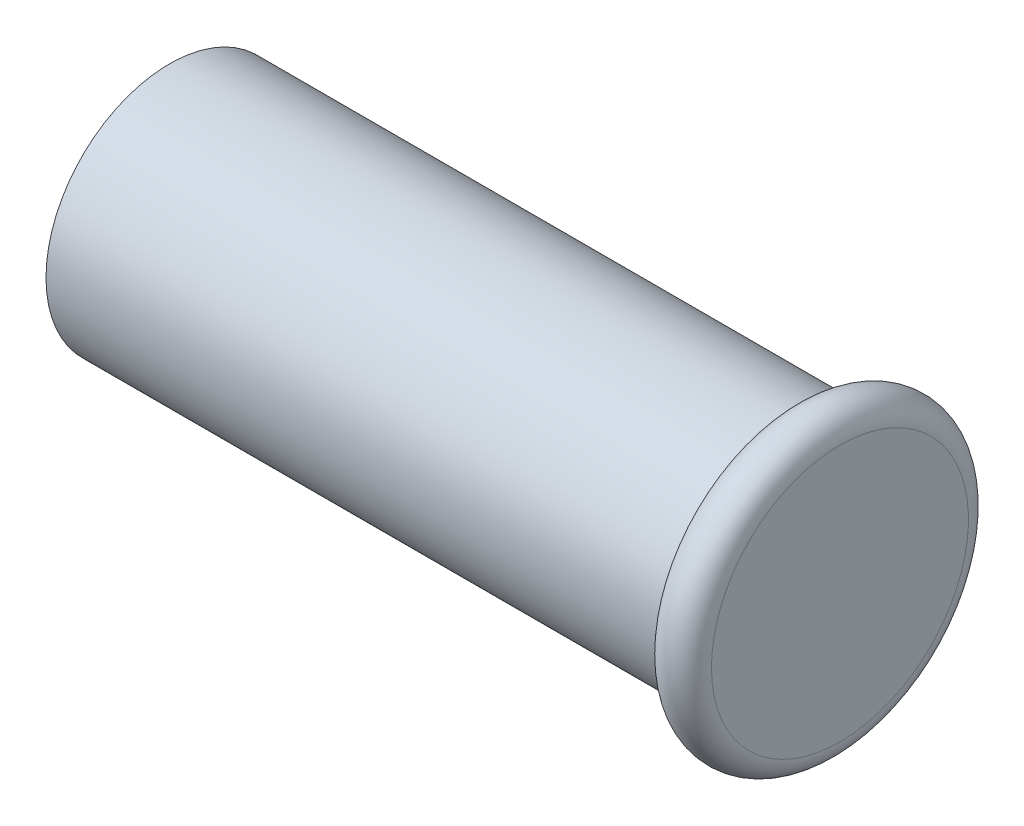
ISO-10303-21;
HEADER;
FILE_DESCRIPTION(('STEP AP214'),'2;1');
FILE_NAME('part.step','',(''),(''),'','','');
FILE_SCHEMA(('AUTOMOTIVE_DESIGN { 1 0 10303 214 1 1 1 1 }'));
ENDSEC;
DATA;
#1=APPLICATION_CONTEXT('core data for automotive mechanical design processes');
#2=APPLICATION_PROTOCOL_DEFINITION('international standard','automotive_design',2000,#1);
#3=PRODUCT_CONTEXT('',#1,'mechanical');
#4=PRODUCT('Part','Part','',(#3));
#5=PRODUCT_RELATED_PRODUCT_CATEGORY('part','',(#4));
#6=PRODUCT_DEFINITION_FORMATION('','',#4);
#7=PRODUCT_DEFINITION_CONTEXT('part definition',#1,'design');
#8=PRODUCT_DEFINITION('design','',#6,#7);
#9=PRODUCT_DEFINITION_SHAPE('','',#8);
#10=(LENGTH_UNIT() NAMED_UNIT(*) SI_UNIT(.MILLI.,.METRE.));
#11=(NAMED_UNIT(*) PLANE_ANGLE_UNIT() SI_UNIT($,.RADIAN.));
#12=(NAMED_UNIT(*) SI_UNIT($,.STERADIAN.) SOLID_ANGLE_UNIT());
#13=UNCERTAINTY_MEASURE_WITH_UNIT(LENGTH_MEASURE(1.E-05),#10,'distance_accuracy_value','');
#14=(GEOMETRIC_REPRESENTATION_CONTEXT(3) GLOBAL_UNCERTAINTY_ASSIGNED_CONTEXT((#13)) GLOBAL_UNIT_ASSIGNED_CONTEXT((#10,
#11,#12)) REPRESENTATION_CONTEXT('',''));
#15=CARTESIAN_POINT('',(0.,0.,0.));
#16=DIRECTION('',(0.,0.,1.));
#17=DIRECTION('',(1.,0.,0.));
#18=AXIS2_PLACEMENT_3D('',#15,#16,#17);
#19=CARTESIAN_POINT('',(0.,0.,0.));
#20=DIRECTION('',(-1.,0.,0.));
#21=DIRECTION('',(0.,0.,1.));
#22=AXIS2_PLACEMENT_3D('',#19,#20,#21);
#23=PLANE('',#22);
#24=CARTESIAN_POINT('',(0.,0.,0.));
#25=DIRECTION('',(-1.,0.,0.));
#26=DIRECTION('',(0.,0.,1.));
#27=AXIS2_PLACEMENT_3D('',#24,#25,#26);
#28=CIRCLE('',#27,2.9845);
#29=CARTESIAN_POINT('',(0.,0.,2.9845));
#30=VERTEX_POINT('',#29);
#31=EDGE_CURVE('E10',#30,#30,#28,.T.);
#32=ORIENTED_EDGE('',*,*,#31,.F.);
#33=EDGE_LOOP('',(#32));
#34=FACE_BOUND('',#33,.T.);
#35=ADVANCED_FACE('F31',(#34),#23,.F.);
#36=CARTESIAN_POINT('',(-0.5461,0.,0.));
#37=DIRECTION('',(-1.,0.,0.));
#38=DIRECTION('',(0.,0.,1.));
#39=AXIS2_PLACEMENT_3D('',#36,#37,#38);
#40=TOROIDAL_SURFACE('',#39,2.9845,0.5461);
#41=CARTESIAN_POINT('',(-1.0922,0.,0.));
#42=DIRECTION('',(-1.,0.,0.));
#43=DIRECTION('',(0.,0.,1.));
#44=AXIS2_PLACEMENT_3D('',#41,#42,#43);
#45=CIRCLE('',#44,2.9845);
#46=CARTESIAN_POINT('',(-1.0922,0.,2.9845));
#47=VERTEX_POINT('',#46);
#48=EDGE_CURVE('E37',#47,#47,#45,.T.);
#49=ORIENTED_EDGE('',*,*,#48,.F.);
#50=EDGE_LOOP('',(#49));
#51=FACE_BOUND('',#50,.T.);
#52=ORIENTED_EDGE('',*,*,#31,.T.);
#53=EDGE_LOOP('',(#52));
#54=FACE_BOUND('',#53,.T.);
#55=ADVANCED_FACE('F79',(#51,#54),#40,.T.);
#56=CARTESIAN_POINT('',(-1.0922,2.9845,0.));
#57=DIRECTION('',(1.,0.,0.));
#58=DIRECTION('',(0.,0.,-1.));
#59=AXIS2_PLACEMENT_3D('',#56,#57,#58);
#60=PLANE('',#59);
#61=CARTESIAN_POINT('',(-1.0922,0.,0.));
#62=DIRECTION('',(-1.,0.,0.));
#63=DIRECTION('',(0.,0.,1.));
#64=AXIS2_PLACEMENT_3D('',#61,#62,#63);
#65=CIRCLE('',#64,2.8702);
#66=CARTESIAN_POINT('',(-1.0922,0.,2.8702));
#67=VERTEX_POINT('',#66);
#68=EDGE_CURVE('E41',#67,#67,#65,.T.);
#69=ORIENTED_EDGE('',*,*,#68,.F.);
#70=EDGE_LOOP('',(#69));
#71=FACE_BOUND('',#70,.T.);
#72=ORIENTED_EDGE('',*,*,#48,.T.);
#73=EDGE_LOOP('',(#72));
#74=FACE_BOUND('',#73,.T.);
#75=ADVANCED_FACE('F74',(#71,#74),#60,.F.);
#76=CARTESIAN_POINT('',(-8.9376792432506,0.,0.));
#77=DIRECTION('',(-1.,0.,0.));
#78=DIRECTION('',(0.,0.,1.));
#79=AXIS2_PLACEMENT_3D('',#76,#77,#78);
#80=CYLINDRICAL_SURFACE('',#79,2.8702);
#81=CARTESIAN_POINT('',(-15.5702,0.,0.));
#82=DIRECTION('',(-1.,0.,0.));
#83=DIRECTION('',(0.,0.,1.));
#84=AXIS2_PLACEMENT_3D('',#81,#82,#83);
#85=CIRCLE('',#84,2.8702);
#86=CARTESIAN_POINT('',(-15.5702,0.,2.8702));
#87=VERTEX_POINT('',#86);
#88=EDGE_CURVE('E45',#87,#87,#85,.T.);
#89=ORIENTED_EDGE('',*,*,#88,.F.);
#90=EDGE_LOOP('',(#89));
#91=FACE_BOUND('',#90,.T.);
#92=ORIENTED_EDGE('',*,*,#68,.T.);
#93=EDGE_LOOP('',(#92));
#94=FACE_BOUND('',#93,.T.);
#95=ADVANCED_FACE('F68',(#91,#94),#80,.T.);
#96=CARTESIAN_POINT('',(-15.5702,2.8702,0.));
#97=DIRECTION('',(1.,0.,0.));
#98=DIRECTION('',(0.,0.,-1.));
#99=AXIS2_PLACEMENT_3D('',#96,#97,#98);
#100=PLANE('',#99);
#101=CARTESIAN_POINT('',(-15.5702,0.,0.));
#102=DIRECTION('',(-1.,0.,0.));
#103=DIRECTION('',(0.,0.,1.));
#104=AXIS2_PLACEMENT_3D('',#101,#102,#103);
#105=CIRCLE('',#104,2.54);
#106=CARTESIAN_POINT('',(-15.5702,0.,2.54));
#107=VERTEX_POINT('',#106);
#108=EDGE_CURVE('E50',#107,#107,#105,.T.);
#109=ORIENTED_EDGE('',*,*,#108,.F.);
#110=EDGE_LOOP('',(#109));
#111=FACE_BOUND('',#110,.T.);
#112=ORIENTED_EDGE('',*,*,#88,.T.);
#113=EDGE_LOOP('',(#112));
#114=FACE_BOUND('',#113,.T.);
#115=ADVANCED_FACE('F62',(#111,#114),#100,.F.);
#116=CARTESIAN_POINT('',(-8.9376792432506,0.,0.));
#117=DIRECTION('',(-1.,0.,0.));
#118=DIRECTION('',(0.,0.,1.));
#119=AXIS2_PLACEMENT_3D('',#116,#117,#118);
#120=CYLINDRICAL_SURFACE('',#119,2.54);
#121=CARTESIAN_POINT('',(-1.27,0.,0.));
#122=DIRECTION('',(-1.,0.,0.));
#123=DIRECTION('',(0.,0.,1.));
#124=AXIS2_PLACEMENT_3D('',#121,#122,#123);
#125=CIRCLE('',#124,2.54);
#126=CARTESIAN_POINT('',(-1.27,0.,2.54));
#127=VERTEX_POINT('',#126);
#128=EDGE_CURVE('E53',#127,#127,#125,.T.);
#129=ORIENTED_EDGE('',*,*,#128,.F.);
#130=EDGE_LOOP('',(#129));
#131=FACE_BOUND('',#130,.T.);
#132=ORIENTED_EDGE('',*,*,#108,.T.);
#133=EDGE_LOOP('',(#132));
#134=FACE_BOUND('',#133,.T.);
#135=ADVANCED_FACE('F59',(#131,#134),#120,.F.);
#136=CARTESIAN_POINT('',(-1.27,2.54,0.));
#137=DIRECTION('',(1.,0.,0.));
#138=DIRECTION('',(0.,0.,-1.));
#139=AXIS2_PLACEMENT_3D('',#136,#137,#138);
#140=PLANE('',#139);
#141=ORIENTED_EDGE('',*,*,#128,.T.);
#142=EDGE_LOOP('',(#141));
#143=FACE_BOUND('',#142,.T.);
#144=ADVANCED_FACE('F57',(#143),#140,.F.);
#145=CLOSED_SHELL('',(#35,#55,#75,#95,#115,#135,#144));
#146=MANIFOLD_SOLID_BREP('B2',#145);
#147=ADVANCED_BREP_SHAPE_REPRESENTATION('',(#18,#146),#14);
#148=SHAPE_DEFINITION_REPRESENTATION(#9,#147);
ENDSEC;
END-ISO-10303-21;
